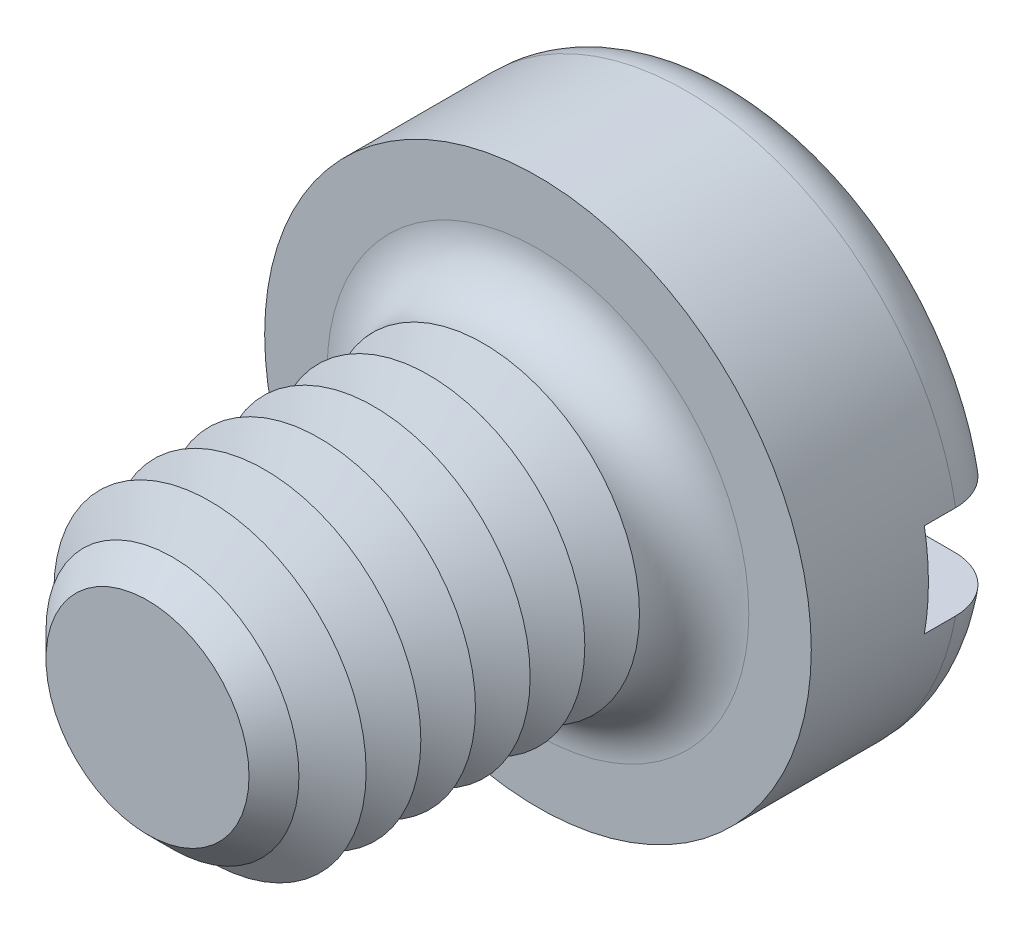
from build123d import *

# Parameters (mm, degrees)
SKETCH3_R           = 3.5
BOSS_EXTRUDE2_DEPTH = 2.6
SKETCH4_R           = 2
BOSS_EXTRUDE3_DEPTH = 5
FILLET1_R           = 0.7
CHAMFER1_SIZE       = 0.7
LPATTERN1_COUNT     = 6
LPATTERN1_PITCH     = 0.7
SKETCH8_W           = 7
SKETCH8_H           = 1.2
CUT_EXTRUDE1_DEPTH  = 1.1


with BuildPart() as part:
    # Sketch3 → Boss-Extrude2 (new body)
    with BuildSketch(Plane.XY):
        Circle(SKETCH3_R)
    extrude(amount=-BOSS_EXTRUDE2_DEPTH)

    # Sketch4 → Boss-Extrude3 (add)
    with BuildSketch(Plane.XY):
        Circle(SKETCH4_R)
    extrude(amount=BOSS_EXTRUDE3_DEPTH)

    # Fillet1
    fillet1_edges = [part.edges().sort_by_distance(p)[0] for p in [
        (-3.5, 0, -2.6),
        (-2, 0, 0),
    ]]
    fillet(fillet1_edges, radius=FILLET1_R)

    # Chamfer1
    chamfer1_edges = [part.edges().sort_by_distance(p)[0] for p in [
        (-2, 0, 5),
    ]]
    chamfer(chamfer1_edges, length=CHAMFER1_SIZE)

    # Sketch6 → Cut-Revolve1 (revolve, cut)
    with BuildSketch(Plane(origin=(0, 0, 0), x_dir=(0, 0, -1), z_dir=(1, 0, 0)), mode=Mode.PRIVATE) as cut_revolve1_sk:
        Polygon((-0.7, 2), (-1.05, 1.393782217), (-1.4, 2), align=None)
    cut_revolve1 = revolve(cut_revolve1_sk.sketch.rotate(Axis((0, 0, -1.694361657), (0, 0, 1)), 90), axis=Axis((0, 0, -1.694361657), (0, 0, 1)), mode=Mode.SUBTRACT)

    # LPattern1: Cut-Revolve1 ×6
    with Locations(*[(0, 0, i * LPATTERN1_PITCH) for i in range(1, LPATTERN1_COUNT)]):
        add(cut_revolve1, mode=Mode.SUBTRACT)

    # Sketch8 → Cut-Extrude1 (cut)
    with BuildSketch(Plane(origin=(0, 0, -2.6), x_dir=(-1, 0, 0), z_dir=(0, 0, -1))):
        Rectangle(SKETCH8_W, SKETCH8_H)
    extrude(amount=-CUT_EXTRUDE1_DEPTH, mode=Mode.SUBTRACT)


solid = part.part
